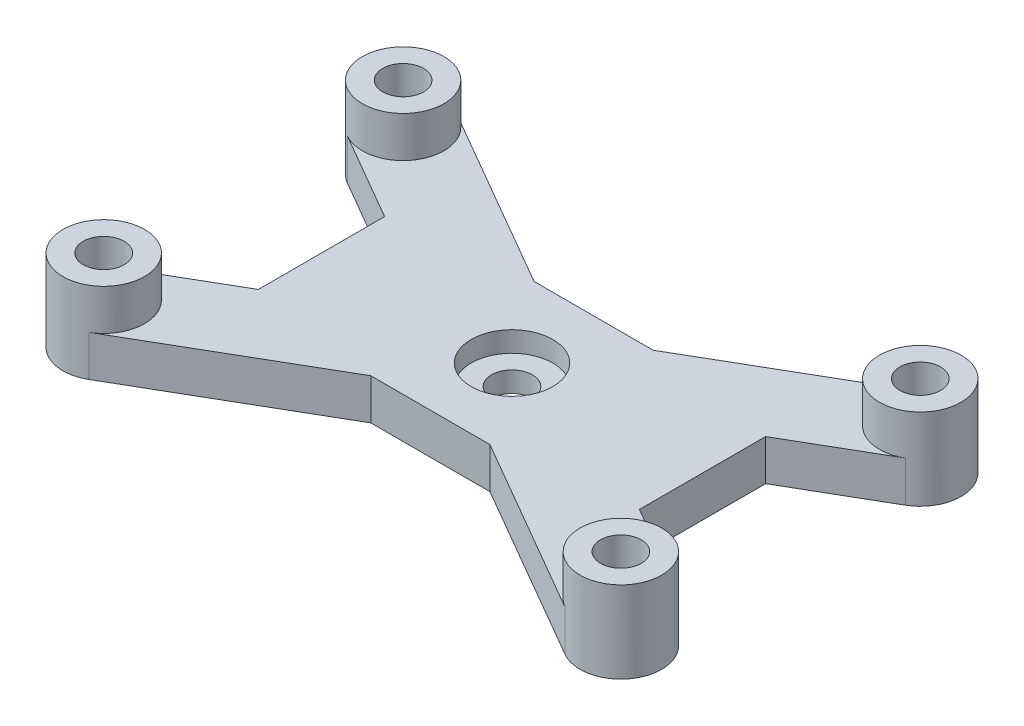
from build123d import *

# Parameters (mm, degrees)
ESBO_O1_R                = 1.5
RESSALTO_EXTRUS_O1_DEPTH = 3
ESBO_O2_R                = 3
CORTE_EXTRUS_O1_DEPTH    = 1.5
ESBO_O3_R                = 3
ESBO_O3_R_2              = 1.5
RESSALTO_EXTRUS_O2_DEPTH = 3


with BuildPart() as part:
    # Esbo_o1 → Ressalto-extrus_o1 (new body)
    with BuildSketch(Plane(origin=(0, 0, 0), x_dir=(1, 0, 0), z_dir=(0, 1, 0))):
        with BuildLine():
            Line((-13.071136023, 4.25406128), (-6.568027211, 0.489103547))
            Line((-6.568027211, 0.489103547), (-6.568027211, -8.788423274))
            Line((-6.568027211, -8.788423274), (-13.071136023, -12.553381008))
            ThreePointArc((-13.071136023, -12.553381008), (-14.164306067, -16.652768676), (-10.064918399, -17.74593872))
            Line((-10.064918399, -17.74593872), (3.055926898, -10.149659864))
            Line((3.055926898, -10.149659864), (11.80801868, -10.149659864))
            Line((11.80801868, -10.149659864), (24.928863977, -17.74593872))
            ThreePointArc((24.928863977, -17.74593872), (29.028251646, -16.652768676), (27.935081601, -12.553381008))
            Line((27.935081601, -12.553381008), (21.431972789, -8.788423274))
            Line((21.431972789, -8.788423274), (21.431972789, 0.489103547))
            Line((21.431972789, 0.489103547), (27.935081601, 4.25406128))
            ThreePointArc((27.935081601, 4.25406128), (29.028251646, 8.353448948), (24.928863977, 9.446618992))
            Line((24.928863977, 9.446618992), (11.80801868, 1.850340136))
            Line((11.80801868, 1.850340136), (3.055926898, 1.850340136))
            Line((3.055926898, 1.850340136), (-10.064918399, 9.446618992))
            ThreePointArc((-10.064918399, 9.446618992), (-14.164306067, 8.353448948), (-13.071136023, 4.25406128))
        make_face()
        with Locations(Location((-11.568027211, 6.850340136, 0), (0, 0, 270))):
            Circle(ESBO_O1_R, mode=Mode.SUBTRACT)
        with Locations(Location((26.431972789, 6.850340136, 0), (0, 0, 270))):
            Circle(ESBO_O1_R, mode=Mode.SUBTRACT)
        with Locations(Location((-11.568027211, -15.149659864, 0), (0, 0, 270))):
            Circle(ESBO_O1_R, mode=Mode.SUBTRACT)
        with Locations(Location((26.431972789, -15.149659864, 0), (0, 0, 270))):
            Circle(ESBO_O1_R, mode=Mode.SUBTRACT)
        with Locations(Location((7.431972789, -4.149659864, 0), (0, 0, 270))):
            Circle(ESBO_O1_R, mode=Mode.SUBTRACT)
    extrude(amount=RESSALTO_EXTRUS_O1_DEPTH)

    # Esbo_o2 → Corte-extrus_o1 (cut)
    with BuildSketch(Plane(origin=(0, 3, 0), x_dir=(1, 0, 0), z_dir=(0, 1, 0))):
        with Locations(Location((7.431972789, -4.149659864, 0), (0, 0, 270))):
            Circle(ESBO_O2_R)
    extrude(amount=-CORTE_EXTRUS_O1_DEPTH, mode=Mode.SUBTRACT)

    # Esbo_o3 → Ressalto-extrus_o2 (add)
    # profile 1 of 4: a face of its own
    with BuildSketch(Plane(origin=(0, 3, 0), x_dir=(1, 0, 0), z_dir=(0, 1, 0))):
        with Locations(Location((-11.568027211, 6.850340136, 0), (0, 0, 59.931417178))):
            Circle(ESBO_O3_R)
        with Locations(Location((-11.568027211, 6.850340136, 0), (0, 0, 270))):
            Circle(ESBO_O3_R_2, mode=Mode.SUBTRACT)
    # profile 2 of 4: a face of its own
    with BuildSketch(Plane(origin=(0, 3, 0), x_dir=(1, 0, 0), z_dir=(0, 1, 0))):
        with Locations(Location((26.431972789, 6.850340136, 0), (0, 0, 120.068582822))):
            Circle(ESBO_O3_R)
        with Locations(Location((26.431972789, 6.850340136, 0), (0, 0, 270))):
            Circle(ESBO_O3_R_2, mode=Mode.SUBTRACT)
    # profile 3 of 4: a face of its own
    with BuildSketch(Plane(origin=(0, 3, 0), x_dir=(1, 0, 0), z_dir=(0, 1, 0))):
        with Locations(Location((26.431972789, -15.149659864, 0), (0, 0, 59.931417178))):
            Circle(ESBO_O3_R)
        with Locations(Location((26.431972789, -15.149659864, 0), (0, 0, 270))):
            Circle(ESBO_O3_R_2, mode=Mode.SUBTRACT)
    # profile 4 of 4: a face of its own
    with BuildSketch(Plane(origin=(0, 3, 0), x_dir=(1, 0, 0), z_dir=(0, 1, 0))):
        with Locations(Location((-11.568027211, -15.149659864, 0), (0, 0, 120.068582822))):
            Circle(ESBO_O3_R)
        with Locations(Location((-11.568027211, -15.149659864, 0), (0, 0, 270))):
            Circle(ESBO_O3_R_2, mode=Mode.SUBTRACT)
    extrude(amount=RESSALTO_EXTRUS_O2_DEPTH)


solid = part.part
